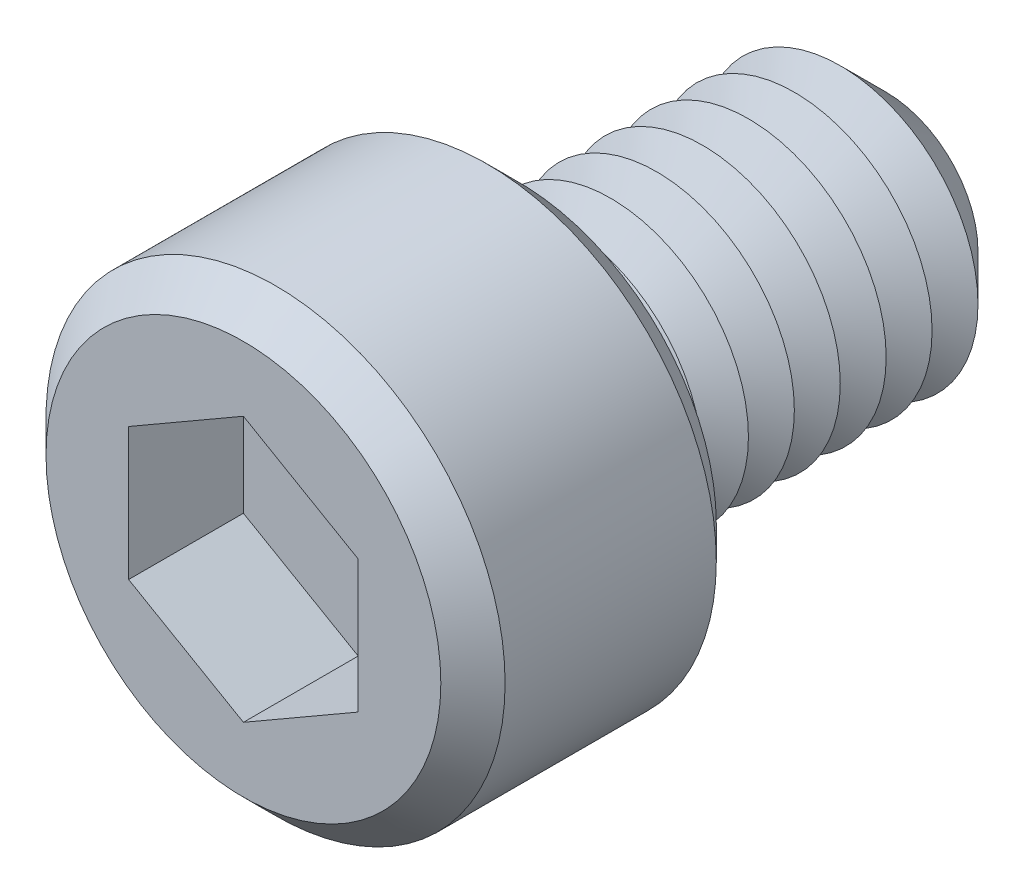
ISO-10303-21;
HEADER;
FILE_DESCRIPTION(('STEP AP214'),'2;1');
FILE_NAME('part.step','',(''),(''),'','','');
FILE_SCHEMA(('AUTOMOTIVE_DESIGN { 1 0 10303 214 1 1 1 1 }'));
ENDSEC;
DATA;
#1=APPLICATION_CONTEXT('core data for automotive mechanical design processes');
#2=APPLICATION_PROTOCOL_DEFINITION('international standard','automotive_design',2000,#1);
#3=PRODUCT_CONTEXT('',#1,'mechanical');
#4=PRODUCT('Part','Part','',(#3));
#5=PRODUCT_RELATED_PRODUCT_CATEGORY('part','',(#4));
#6=PRODUCT_DEFINITION_FORMATION('','',#4);
#7=PRODUCT_DEFINITION_CONTEXT('part definition',#1,'design');
#8=PRODUCT_DEFINITION('design','',#6,#7);
#9=PRODUCT_DEFINITION_SHAPE('','',#8);
#10=(LENGTH_UNIT() NAMED_UNIT(*) SI_UNIT(.MILLI.,.METRE.));
#11=(NAMED_UNIT(*) PLANE_ANGLE_UNIT() SI_UNIT($,.RADIAN.));
#12=(NAMED_UNIT(*) SI_UNIT($,.STERADIAN.) SOLID_ANGLE_UNIT());
#13=UNCERTAINTY_MEASURE_WITH_UNIT(LENGTH_MEASURE(1.E-05),#10,'distance_accuracy_value','');
#14=(GEOMETRIC_REPRESENTATION_CONTEXT(3) GLOBAL_UNCERTAINTY_ASSIGNED_CONTEXT((#13)) GLOBAL_UNIT_ASSIGNED_CONTEXT((#10,
#11,#12)) REPRESENTATION_CONTEXT('',''));
#15=CARTESIAN_POINT('',(0.,0.,0.));
#16=DIRECTION('',(0.,0.,1.));
#17=DIRECTION('',(1.,0.,0.));
#18=AXIS2_PLACEMENT_3D('',#15,#16,#17);
#19=CARTESIAN_POINT('',(0.,0.,6.));
#20=DIRECTION('',(0.,0.,-1.));
#21=DIRECTION('',(-1.,0.,0.));
#22=AXIS2_PLACEMENT_3D('',#19,#20,#21);
#23=CYLINDRICAL_SURFACE('',#22,5.);
#24=CARTESIAN_POINT('',(0.,0.,0.7));
#25=DIRECTION('',(0.,0.,1.));
#26=DIRECTION('',(1.,0.,0.));
#27=AXIS2_PLACEMENT_3D('',#24,#25,#26);
#28=CIRCLE('',#27,5.);
#29=CARTESIAN_POINT('',(5.,0.,0.7));
#30=VERTEX_POINT('',#29);
#31=EDGE_CURVE('E232',#30,#30,#28,.T.);
#32=ORIENTED_EDGE('',*,*,#31,.T.);
#33=EDGE_LOOP('',(#32));
#34=FACE_BOUND('',#33,.T.);
#35=CARTESIAN_POINT('',(0.,0.,5.3));
#36=DIRECTION('',(0.,0.,1.));
#37=DIRECTION('',(1.,0.,0.));
#38=AXIS2_PLACEMENT_3D('',#35,#36,#37);
#39=CIRCLE('',#38,5.);
#40=CARTESIAN_POINT('',(5.,0.,5.3));
#41=VERTEX_POINT('',#40);
#42=EDGE_CURVE('E228',#41,#41,#39,.F.);
#43=ORIENTED_EDGE('',*,*,#42,.T.);
#44=EDGE_LOOP('',(#43));
#45=FACE_BOUND('',#44,.T.);
#46=ADVANCED_FACE('F39',(#34,#45),#23,.T.);
#47=CARTESIAN_POINT('',(0.,0.,6.));
#48=DIRECTION('',(0.,0.,1.));
#49=DIRECTION('',(1.,0.,0.));
#50=AXIS2_PLACEMENT_3D('',#47,#48,#49);
#51=PLANE('',#50);
#52=CARTESIAN_POINT('',(0.,0.,6.));
#53=DIRECTION('',(0.,0.,1.));
#54=DIRECTION('',(1.,0.,0.));
#55=AXIS2_PLACEMENT_3D('',#52,#53,#54);
#56=CIRCLE('',#55,4.30000000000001);
#57=CARTESIAN_POINT('',(4.30000000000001,0.,6.));
#58=VERTEX_POINT('',#57);
#59=EDGE_CURVE('E11',#58,#58,#56,.T.);
#60=ORIENTED_EDGE('',*,*,#59,.T.);
#61=EDGE_LOOP('',(#60));
#62=FACE_BOUND('',#61,.T.);
#63=DIRECTION('',(-0.866025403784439,0.5,0.));
#64=VECTOR('',#63,1.);
#65=CARTESIAN_POINT('',(2.5,1.44337567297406,6.));
#66=LINE('',#65,#64);
#67=CARTESIAN_POINT('',(2.5,1.44337567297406,6.));
#68=VERTEX_POINT('',#67);
#69=CARTESIAN_POINT('',(0.,2.88675134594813,6.));
#70=VERTEX_POINT('',#69);
#71=EDGE_CURVE('E55',#68,#70,#66,.T.);
#72=ORIENTED_EDGE('',*,*,#71,.F.);
#73=DIRECTION('',(0.,1.,0.));
#74=VECTOR('',#73,1.);
#75=CARTESIAN_POINT('',(2.5,-1.44337567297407,6.));
#76=LINE('',#75,#74);
#77=CARTESIAN_POINT('',(2.5,-1.44337567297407,6.));
#78=VERTEX_POINT('',#77);
#79=EDGE_CURVE('E151',#78,#68,#76,.T.);
#80=ORIENTED_EDGE('',*,*,#79,.F.);
#81=DIRECTION('',(0.866025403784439,0.5,0.));
#82=VECTOR('',#81,1.);
#83=CARTESIAN_POINT('',(0.,-2.88675134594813,6.));
#84=LINE('',#83,#82);
#85=CARTESIAN_POINT('',(0.,-2.88675134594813,6.));
#86=VERTEX_POINT('',#85);
#87=EDGE_CURVE('E148',#86,#78,#84,.T.);
#88=ORIENTED_EDGE('',*,*,#87,.F.);
#89=DIRECTION('',(0.866025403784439,-0.5,0.));
#90=VECTOR('',#89,1.);
#91=CARTESIAN_POINT('',(-2.5,-1.44337567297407,6.));
#92=LINE('',#91,#90);
#93=CARTESIAN_POINT('',(-2.5,-1.44337567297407,6.));
#94=VERTEX_POINT('',#93);
#95=EDGE_CURVE('E103',#94,#86,#92,.T.);
#96=ORIENTED_EDGE('',*,*,#95,.F.);
#97=DIRECTION('',(0.,-1.,0.));
#98=VECTOR('',#97,1.);
#99=CARTESIAN_POINT('',(-2.5,1.44337567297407,6.));
#100=LINE('',#99,#98);
#101=CARTESIAN_POINT('',(-2.5,1.44337567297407,6.));
#102=VERTEX_POINT('',#101);
#103=EDGE_CURVE('E142',#102,#94,#100,.T.);
#104=ORIENTED_EDGE('',*,*,#103,.F.);
#105=DIRECTION('',(-0.866025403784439,-0.5,0.));
#106=VECTOR('',#105,1.);
#107=CARTESIAN_POINT('',(0.,2.88675134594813,6.));
#108=LINE('',#107,#106);
#109=EDGE_CURVE('E137',#70,#102,#108,.T.);
#110=ORIENTED_EDGE('',*,*,#109,.F.);
#111=EDGE_LOOP('',(#72,#80,#88,#96,#104,#110));
#112=FACE_BOUND('',#111,.T.);
#113=ADVANCED_FACE('F250',(#62,#112),#51,.T.);
#114=CARTESIAN_POINT('',(0.,0.,0.));
#115=DIRECTION('',(0.,0.,1.));
#116=DIRECTION('',(1.,0.,0.));
#117=AXIS2_PLACEMENT_3D('',#114,#115,#116);
#118=PLANE('',#117);
#119=CARTESIAN_POINT('',(0.,0.,0.));
#120=DIRECTION('',(0.,0.,1.));
#121=DIRECTION('',(1.,0.,0.));
#122=AXIS2_PLACEMENT_3D('',#119,#120,#121);
#123=CIRCLE('',#122,4.3);
#124=CARTESIAN_POINT('',(4.3,0.,0.));
#125=VERTEX_POINT('',#124);
#126=EDGE_CURVE('E48',#125,#125,#123,.F.);
#127=ORIENTED_EDGE('',*,*,#126,.T.);
#128=EDGE_LOOP('',(#127));
#129=FACE_BOUND('',#128,.T.);
#130=CARTESIAN_POINT('',(0.,0.,0.));
#131=DIRECTION('',(0.,0.,1.));
#132=DIRECTION('',(1.,0.,0.));
#133=AXIS2_PLACEMENT_3D('',#130,#131,#132);
#134=CIRCLE('',#133,3.);
#135=CARTESIAN_POINT('',(3.,0.,0.));
#136=VERTEX_POINT('',#135);
#137=EDGE_CURVE('E221',#136,#136,#134,.T.);
#138=ORIENTED_EDGE('',*,*,#137,.T.);
#139=EDGE_LOOP('',(#138));
#140=FACE_BOUND('',#139,.T.);
#141=ADVANCED_FACE('F239',(#129,#140),#118,.F.);
#142=CARTESIAN_POINT('',(0.,0.,0.));
#143=DIRECTION('',(0.,0.,1.));
#144=DIRECTION('',(1.,0.,0.));
#145=AXIS2_PLACEMENT_3D('',#142,#143,#144);
#146=CONICAL_SURFACE('',#145,3.,1.0471975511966);
#147=CARTESIAN_POINT('',(0.,0.,-0.500000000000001));
#148=DIRECTION('',(0.,0.,1.));
#149=DIRECTION('',(1.,0.,0.));
#150=AXIS2_PLACEMENT_3D('',#147,#148,#149);
#151=CIRCLE('',#150,2.13397459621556);
#152=CARTESIAN_POINT('',(2.13397459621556,0.,-0.500000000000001));
#153=VERTEX_POINT('',#152);
#154=EDGE_CURVE('E217',#153,#153,#151,.T.);
#155=ORIENTED_EDGE('',*,*,#154,.T.);
#156=EDGE_LOOP('',(#155));
#157=FACE_BOUND('',#156,.T.);
#158=ORIENTED_EDGE('',*,*,#137,.F.);
#159=EDGE_LOOP('',(#158));
#160=FACE_BOUND('',#159,.T.);
#161=ADVANCED_FACE('F356',(#157,#160),#146,.T.);
#162=CARTESIAN_POINT('',(0.,0.,-0.500000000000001));
#163=DIRECTION('',(0.,0.,-1.));
#164=DIRECTION('',(-1.,0.,0.));
#165=AXIS2_PLACEMENT_3D('',#162,#163,#164);
#166=CONICAL_SURFACE('',#165,2.13397459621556,1.0471975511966);
#167=CARTESIAN_POINT('',(0.,0.,-1.));
#168=DIRECTION('',(0.,0.,1.));
#169=DIRECTION('',(1.,0.,0.));
#170=AXIS2_PLACEMENT_3D('',#167,#168,#169);
#171=CIRCLE('',#170,3.);
#172=CARTESIAN_POINT('',(3.,0.,-1.));
#173=VERTEX_POINT('',#172);
#174=EDGE_CURVE('E213',#173,#173,#171,.T.);
#175=ORIENTED_EDGE('',*,*,#174,.T.);
#176=EDGE_LOOP('',(#175));
#177=FACE_BOUND('',#176,.T.);
#178=ORIENTED_EDGE('',*,*,#154,.F.);
#179=EDGE_LOOP('',(#178));
#180=FACE_BOUND('',#179,.T.);
#181=ADVANCED_FACE('F352',(#177,#180),#166,.T.);
#182=CARTESIAN_POINT('',(0.,0.,-1.));
#183=DIRECTION('',(0.,0.,1.));
#184=DIRECTION('',(1.,0.,0.));
#185=AXIS2_PLACEMENT_3D('',#182,#183,#184);
#186=CONICAL_SURFACE('',#185,3.,1.0471975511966);
#187=CARTESIAN_POINT('',(0.,0.,-1.5));
#188=DIRECTION('',(0.,0.,1.));
#189=DIRECTION('',(1.,0.,0.));
#190=AXIS2_PLACEMENT_3D('',#187,#188,#189);
#191=CIRCLE('',#190,2.13397459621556);
#192=CARTESIAN_POINT('',(2.13397459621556,0.,-1.5));
#193=VERTEX_POINT('',#192);
#194=EDGE_CURVE('E209',#193,#193,#191,.T.);
#195=ORIENTED_EDGE('',*,*,#194,.T.);
#196=EDGE_LOOP('',(#195));
#197=FACE_BOUND('',#196,.T.);
#198=ORIENTED_EDGE('',*,*,#174,.F.);
#199=EDGE_LOOP('',(#198));
#200=FACE_BOUND('',#199,.T.);
#201=ADVANCED_FACE('F348',(#197,#200),#186,.T.);
#202=CARTESIAN_POINT('',(0.,0.,-1.5));
#203=DIRECTION('',(0.,0.,-1.));
#204=DIRECTION('',(-1.,0.,0.));
#205=AXIS2_PLACEMENT_3D('',#202,#203,#204);
#206=CONICAL_SURFACE('',#205,2.13397459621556,1.0471975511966);
#207=CARTESIAN_POINT('',(0.,0.,-2.));
#208=DIRECTION('',(0.,0.,1.));
#209=DIRECTION('',(1.,0.,0.));
#210=AXIS2_PLACEMENT_3D('',#207,#208,#209);
#211=CIRCLE('',#210,3.);
#212=CARTESIAN_POINT('',(3.,0.,-2.));
#213=VERTEX_POINT('',#212);
#214=EDGE_CURVE('E205',#213,#213,#211,.T.);
#215=ORIENTED_EDGE('',*,*,#214,.T.);
#216=EDGE_LOOP('',(#215));
#217=FACE_BOUND('',#216,.T.);
#218=ORIENTED_EDGE('',*,*,#194,.F.);
#219=EDGE_LOOP('',(#218));
#220=FACE_BOUND('',#219,.T.);
#221=ADVANCED_FACE('F344',(#217,#220),#206,.T.);
#222=CARTESIAN_POINT('',(0.,0.,-2.));
#223=DIRECTION('',(0.,0.,1.));
#224=DIRECTION('',(1.,0.,0.));
#225=AXIS2_PLACEMENT_3D('',#222,#223,#224);
#226=CONICAL_SURFACE('',#225,3.,1.0471975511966);
#227=CARTESIAN_POINT('',(0.,0.,-2.5));
#228=DIRECTION('',(0.,0.,1.));
#229=DIRECTION('',(1.,0.,0.));
#230=AXIS2_PLACEMENT_3D('',#227,#228,#229);
#231=CIRCLE('',#230,2.13397459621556);
#232=CARTESIAN_POINT('',(2.13397459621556,0.,-2.5));
#233=VERTEX_POINT('',#232);
#234=EDGE_CURVE('E202',#233,#233,#231,.T.);
#235=ORIENTED_EDGE('',*,*,#234,.T.);
#236=EDGE_LOOP('',(#235));
#237=FACE_BOUND('',#236,.T.);
#238=ORIENTED_EDGE('',*,*,#214,.F.);
#239=EDGE_LOOP('',(#238));
#240=FACE_BOUND('',#239,.T.);
#241=ADVANCED_FACE('F340',(#237,#240),#226,.T.);
#242=CARTESIAN_POINT('',(0.,0.,-2.5));
#243=DIRECTION('',(0.,0.,-1.));
#244=DIRECTION('',(-1.,0.,0.));
#245=AXIS2_PLACEMENT_3D('',#242,#243,#244);
#246=CONICAL_SURFACE('',#245,2.13397459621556,1.0471975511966);
#247=CARTESIAN_POINT('',(0.,0.,-3.));
#248=DIRECTION('',(0.,0.,1.));
#249=DIRECTION('',(1.,0.,0.));
#250=AXIS2_PLACEMENT_3D('',#247,#248,#249);
#251=CIRCLE('',#250,3.);
#252=CARTESIAN_POINT('',(3.,0.,-3.));
#253=VERTEX_POINT('',#252);
#254=EDGE_CURVE('E198',#253,#253,#251,.T.);
#255=ORIENTED_EDGE('',*,*,#254,.T.);
#256=EDGE_LOOP('',(#255));
#257=FACE_BOUND('',#256,.T.);
#258=ORIENTED_EDGE('',*,*,#234,.F.);
#259=EDGE_LOOP('',(#258));
#260=FACE_BOUND('',#259,.T.);
#261=ADVANCED_FACE('F336',(#257,#260),#246,.T.);
#262=CARTESIAN_POINT('',(0.,0.,-3.));
#263=DIRECTION('',(0.,0.,1.));
#264=DIRECTION('',(1.,0.,0.));
#265=AXIS2_PLACEMENT_3D('',#262,#263,#264);
#266=CONICAL_SURFACE('',#265,3.,1.0471975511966);
#267=CARTESIAN_POINT('',(0.,0.,-3.5));
#268=DIRECTION('',(0.,0.,1.));
#269=DIRECTION('',(1.,0.,0.));
#270=AXIS2_PLACEMENT_3D('',#267,#268,#269);
#271=CIRCLE('',#270,2.13397459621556);
#272=CARTESIAN_POINT('',(2.13397459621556,0.,-3.5));
#273=VERTEX_POINT('',#272);
#274=EDGE_CURVE('E194',#273,#273,#271,.T.);
#275=ORIENTED_EDGE('',*,*,#274,.T.);
#276=EDGE_LOOP('',(#275));
#277=FACE_BOUND('',#276,.T.);
#278=ORIENTED_EDGE('',*,*,#254,.F.);
#279=EDGE_LOOP('',(#278));
#280=FACE_BOUND('',#279,.T.);
#281=ADVANCED_FACE('F332',(#277,#280),#266,.T.);
#282=CARTESIAN_POINT('',(0.,0.,-3.5));
#283=DIRECTION('',(0.,0.,-1.));
#284=DIRECTION('',(-1.,0.,0.));
#285=AXIS2_PLACEMENT_3D('',#282,#283,#284);
#286=CONICAL_SURFACE('',#285,2.13397459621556,1.0471975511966);
#287=CARTESIAN_POINT('',(0.,0.,-4.));
#288=DIRECTION('',(0.,0.,1.));
#289=DIRECTION('',(1.,0.,0.));
#290=AXIS2_PLACEMENT_3D('',#287,#288,#289);
#291=CIRCLE('',#290,3.);
#292=CARTESIAN_POINT('',(3.,0.,-4.));
#293=VERTEX_POINT('',#292);
#294=EDGE_CURVE('E190',#293,#293,#291,.T.);
#295=ORIENTED_EDGE('',*,*,#294,.T.);
#296=EDGE_LOOP('',(#295));
#297=FACE_BOUND('',#296,.T.);
#298=ORIENTED_EDGE('',*,*,#274,.F.);
#299=EDGE_LOOP('',(#298));
#300=FACE_BOUND('',#299,.T.);
#301=ADVANCED_FACE('F328',(#297,#300),#286,.T.);
#302=CARTESIAN_POINT('',(0.,0.,-4.));
#303=DIRECTION('',(0.,0.,1.));
#304=DIRECTION('',(1.,0.,0.));
#305=AXIS2_PLACEMENT_3D('',#302,#303,#304);
#306=CONICAL_SURFACE('',#305,3.,1.0471975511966);
#307=CARTESIAN_POINT('',(0.,0.,-4.5));
#308=DIRECTION('',(0.,0.,1.));
#309=DIRECTION('',(1.,0.,0.));
#310=AXIS2_PLACEMENT_3D('',#307,#308,#309);
#311=CIRCLE('',#310,2.13397459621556);
#312=CARTESIAN_POINT('',(2.13397459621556,0.,-4.5));
#313=VERTEX_POINT('',#312);
#314=EDGE_CURVE('E186',#313,#313,#311,.T.);
#315=ORIENTED_EDGE('',*,*,#314,.T.);
#316=EDGE_LOOP('',(#315));
#317=FACE_BOUND('',#316,.T.);
#318=ORIENTED_EDGE('',*,*,#294,.F.);
#319=EDGE_LOOP('',(#318));
#320=FACE_BOUND('',#319,.T.);
#321=ADVANCED_FACE('F324',(#317,#320),#306,.T.);
#322=CARTESIAN_POINT('',(0.,0.,-4.5));
#323=DIRECTION('',(0.,0.,-1.));
#324=DIRECTION('',(-1.,0.,0.));
#325=AXIS2_PLACEMENT_3D('',#322,#323,#324);
#326=CONICAL_SURFACE('',#325,2.13397459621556,1.0471975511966);
#327=CARTESIAN_POINT('',(0.,0.,-5.));
#328=DIRECTION('',(0.,0.,1.));
#329=DIRECTION('',(1.,0.,0.));
#330=AXIS2_PLACEMENT_3D('',#327,#328,#329);
#331=CIRCLE('',#330,3.);
#332=CARTESIAN_POINT('',(3.,0.,-5.));
#333=VERTEX_POINT('',#332);
#334=EDGE_CURVE('E182',#333,#333,#331,.T.);
#335=ORIENTED_EDGE('',*,*,#334,.T.);
#336=EDGE_LOOP('',(#335));
#337=FACE_BOUND('',#336,.T.);
#338=ORIENTED_EDGE('',*,*,#314,.F.);
#339=EDGE_LOOP('',(#338));
#340=FACE_BOUND('',#339,.T.);
#341=ADVANCED_FACE('F320',(#337,#340),#326,.T.);
#342=CARTESIAN_POINT('',(0.,0.,-5.));
#343=DIRECTION('',(0.,0.,1.));
#344=DIRECTION('',(1.,0.,0.));
#345=AXIS2_PLACEMENT_3D('',#342,#343,#344);
#346=CONICAL_SURFACE('',#345,3.,1.0471975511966);
#347=CARTESIAN_POINT('',(0.,0.,-5.5));
#348=DIRECTION('',(0.,0.,1.));
#349=DIRECTION('',(1.,0.,0.));
#350=AXIS2_PLACEMENT_3D('',#347,#348,#349);
#351=CIRCLE('',#350,2.13397459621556);
#352=CARTESIAN_POINT('',(2.13397459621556,0.,-5.5));
#353=VERTEX_POINT('',#352);
#354=EDGE_CURVE('E178',#353,#353,#351,.T.);
#355=ORIENTED_EDGE('',*,*,#354,.T.);
#356=EDGE_LOOP('',(#355));
#357=FACE_BOUND('',#356,.T.);
#358=ORIENTED_EDGE('',*,*,#334,.F.);
#359=EDGE_LOOP('',(#358));
#360=FACE_BOUND('',#359,.T.);
#361=ADVANCED_FACE('F316',(#357,#360),#346,.T.);
#362=CARTESIAN_POINT('',(0.,0.,-5.5));
#363=DIRECTION('',(0.,0.,-1.));
#364=DIRECTION('',(-1.,0.,0.));
#365=AXIS2_PLACEMENT_3D('',#362,#363,#364);
#366=CONICAL_SURFACE('',#365,2.13397459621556,1.0471975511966);
#367=CARTESIAN_POINT('',(0.,0.,-6.));
#368=DIRECTION('',(0.,0.,1.));
#369=DIRECTION('',(1.,0.,0.));
#370=AXIS2_PLACEMENT_3D('',#367,#368,#369);
#371=CIRCLE('',#370,3.);
#372=CARTESIAN_POINT('',(3.,0.,-6.));
#373=VERTEX_POINT('',#372);
#374=EDGE_CURVE('E174',#373,#373,#371,.T.);
#375=ORIENTED_EDGE('',*,*,#374,.T.);
#376=EDGE_LOOP('',(#375));
#377=FACE_BOUND('',#376,.T.);
#378=ORIENTED_EDGE('',*,*,#354,.F.);
#379=EDGE_LOOP('',(#378));
#380=FACE_BOUND('',#379,.T.);
#381=ADVANCED_FACE('F312',(#377,#380),#366,.T.);
#382=CARTESIAN_POINT('',(0.,0.,-6.));
#383=DIRECTION('',(0.,0.,1.));
#384=DIRECTION('',(1.,0.,0.));
#385=AXIS2_PLACEMENT_3D('',#382,#383,#384);
#386=CONICAL_SURFACE('',#385,3.,1.0471975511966);
#387=CARTESIAN_POINT('',(0.,0.,-6.5));
#388=DIRECTION('',(0.,0.,1.));
#389=DIRECTION('',(1.,0.,0.));
#390=AXIS2_PLACEMENT_3D('',#387,#388,#389);
#391=CIRCLE('',#390,2.13397459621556);
#392=CARTESIAN_POINT('',(2.13397459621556,0.,-6.5));
#393=VERTEX_POINT('',#392);
#394=EDGE_CURVE('E170',#393,#393,#391,.T.);
#395=ORIENTED_EDGE('',*,*,#394,.T.);
#396=EDGE_LOOP('',(#395));
#397=FACE_BOUND('',#396,.T.);
#398=ORIENTED_EDGE('',*,*,#374,.F.);
#399=EDGE_LOOP('',(#398));
#400=FACE_BOUND('',#399,.T.);
#401=ADVANCED_FACE('F308',(#397,#400),#386,.T.);
#402=CARTESIAN_POINT('',(0.,0.,-6.5));
#403=DIRECTION('',(0.,0.,-1.));
#404=DIRECTION('',(-1.,0.,0.));
#405=AXIS2_PLACEMENT_3D('',#402,#403,#404);
#406=CONICAL_SURFACE('',#405,2.13397459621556,1.0471975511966);
#407=CARTESIAN_POINT('',(0.,0.,-7.));
#408=DIRECTION('',(0.,0.,1.));
#409=DIRECTION('',(1.,0.,0.));
#410=AXIS2_PLACEMENT_3D('',#407,#408,#409);
#411=CIRCLE('',#410,3.);
#412=CARTESIAN_POINT('',(3.,0.,-7.));
#413=VERTEX_POINT('',#412);
#414=EDGE_CURVE('E157',#413,#413,#411,.T.);
#415=ORIENTED_EDGE('',*,*,#414,.T.);
#416=EDGE_LOOP('',(#415));
#417=FACE_BOUND('',#416,.T.);
#418=ORIENTED_EDGE('',*,*,#394,.F.);
#419=EDGE_LOOP('',(#418));
#420=FACE_BOUND('',#419,.T.);
#421=ADVANCED_FACE('F304',(#417,#420),#406,.T.);
#422=CARTESIAN_POINT('',(0.,0.,-8.));
#423=DIRECTION('',(0.,0.,-1.));
#424=DIRECTION('',(-1.,0.,0.));
#425=AXIS2_PLACEMENT_3D('',#422,#423,#424);
#426=PLANE('',#425);
#427=CARTESIAN_POINT('',(0.,0.,-8.));
#428=DIRECTION('',(0.,0.,-1.));
#429=DIRECTION('',(-1.,0.,0.));
#430=AXIS2_PLACEMENT_3D('',#427,#428,#429);
#431=CIRCLE('',#430,0.8);
#432=CARTESIAN_POINT('',(-0.8,0.,-8.));
#433=VERTEX_POINT('',#432);
#434=EDGE_CURVE('E138',#433,#433,#431,.F.);
#435=ORIENTED_EDGE('',*,*,#434,.T.);
#436=EDGE_LOOP('',(#435));
#437=FACE_BOUND('',#436,.T.);
#438=CARTESIAN_POINT('',(0.,0.,-8.));
#439=DIRECTION('',(0.,0.,-1.));
#440=DIRECTION('',(-1.,0.,0.));
#441=AXIS2_PLACEMENT_3D('',#438,#439,#440);
#442=CIRCLE('',#441,2.);
#443=CARTESIAN_POINT('',(-2.,0.,-8.));
#444=VERTEX_POINT('',#443);
#445=EDGE_CURVE('E224',#444,#444,#442,.T.);
#446=ORIENTED_EDGE('',*,*,#445,.T.);
#447=EDGE_LOOP('',(#446));
#448=FACE_BOUND('',#447,.T.);
#449=ADVANCED_FACE('F307',(#437,#448),#426,.T.);
#450=CARTESIAN_POINT('',(0.,0.,-8.));
#451=DIRECTION('',(0.,0.,1.));
#452=DIRECTION('',(1.,0.,0.));
#453=AXIS2_PLACEMENT_3D('',#450,#451,#452);
#454=CONICAL_SURFACE('',#453,2.,0.785398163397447);
#455=ORIENTED_EDGE('',*,*,#414,.F.);
#456=EDGE_LOOP('',(#455));
#457=FACE_BOUND('',#456,.T.);
#458=ORIENTED_EDGE('',*,*,#445,.F.);
#459=EDGE_LOOP('',(#458));
#460=FACE_BOUND('',#459,.T.);
#461=ADVANCED_FACE('F303',(#457,#460),#454,.T.);
#462=CARTESIAN_POINT('',(2.5,1.44337567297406,3.5));
#463=DIRECTION('',(0.5,0.866025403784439,0.));
#464=DIRECTION('',(-0.866025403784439,0.5,0.));
#465=AXIS2_PLACEMENT_3D('',#462,#463,#464);
#466=PLANE('',#465);
#467=ORIENTED_EDGE('',*,*,#71,.T.);
#468=DIRECTION('',(0.,0.,1.));
#469=VECTOR('',#468,1.);
#470=CARTESIAN_POINT('',(0.,2.88675134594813,3.5));
#471=LINE('',#470,#469);
#472=CARTESIAN_POINT('',(0.,2.88675134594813,3.5));
#473=VERTEX_POINT('',#472);
#474=EDGE_CURVE('E85',#473,#70,#471,.T.);
#475=ORIENTED_EDGE('',*,*,#474,.F.);
#476=DIRECTION('',(-0.866025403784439,0.5,0.));
#477=VECTOR('',#476,1.);
#478=CARTESIAN_POINT('',(2.5,1.44337567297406,3.5));
#479=LINE('',#478,#477);
#480=CARTESIAN_POINT('',(2.5,1.44337567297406,3.5));
#481=VERTEX_POINT('',#480);
#482=EDGE_CURVE('E154',#481,#473,#479,.T.);
#483=ORIENTED_EDGE('',*,*,#482,.F.);
#484=DIRECTION('',(0.,0.,1.));
#485=VECTOR('',#484,1.);
#486=CARTESIAN_POINT('',(2.5,1.44337567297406,3.5));
#487=LINE('',#486,#485);
#488=EDGE_CURVE('E63',#481,#68,#487,.T.);
#489=ORIENTED_EDGE('',*,*,#488,.T.);
#490=EDGE_LOOP('',(#467,#475,#483,#489));
#491=FACE_BOUND('',#490,.T.);
#492=ADVANCED_FACE('F293',(#491),#466,.F.);
#493=CARTESIAN_POINT('',(2.5,-1.44337567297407,3.5));
#494=DIRECTION('',(1.,0.,0.));
#495=DIRECTION('',(0.,1.,0.));
#496=AXIS2_PLACEMENT_3D('',#493,#494,#495);
#497=PLANE('',#496);
#498=ORIENTED_EDGE('',*,*,#79,.T.);
#499=ORIENTED_EDGE('',*,*,#488,.F.);
#500=DIRECTION('',(0.,1.,0.));
#501=VECTOR('',#500,1.);
#502=CARTESIAN_POINT('',(2.5,-1.44337567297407,3.5));
#503=LINE('',#502,#501);
#504=CARTESIAN_POINT('',(2.5,-1.44337567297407,3.5));
#505=VERTEX_POINT('',#504);
#506=EDGE_CURVE('E117',#505,#481,#503,.T.);
#507=ORIENTED_EDGE('',*,*,#506,.F.);
#508=DIRECTION('',(0.,0.,1.));
#509=VECTOR('',#508,1.);
#510=CARTESIAN_POINT('',(2.5,-1.44337567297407,3.5));
#511=LINE('',#510,#509);
#512=EDGE_CURVE('E108',#505,#78,#511,.T.);
#513=ORIENTED_EDGE('',*,*,#512,.T.);
#514=EDGE_LOOP('',(#498,#499,#507,#513));
#515=FACE_BOUND('',#514,.T.);
#516=ADVANCED_FACE('F290',(#515),#497,.F.);
#517=CARTESIAN_POINT('',(0.,-2.88675134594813,3.5));
#518=DIRECTION('',(0.5,-0.866025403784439,0.));
#519=DIRECTION('',(0.866025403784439,0.5,0.));
#520=AXIS2_PLACEMENT_3D('',#517,#518,#519);
#521=PLANE('',#520);
#522=ORIENTED_EDGE('',*,*,#87,.T.);
#523=ORIENTED_EDGE('',*,*,#512,.F.);
#524=DIRECTION('',(0.866025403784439,0.5,0.));
#525=VECTOR('',#524,1.);
#526=CARTESIAN_POINT('',(0.,-2.88675134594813,3.5));
#527=LINE('',#526,#525);
#528=CARTESIAN_POINT('',(0.,-2.88675134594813,3.5));
#529=VERTEX_POINT('',#528);
#530=EDGE_CURVE('E112',#529,#505,#527,.T.);
#531=ORIENTED_EDGE('',*,*,#530,.F.);
#532=DIRECTION('',(0.,0.,1.));
#533=VECTOR('',#532,1.);
#534=CARTESIAN_POINT('',(0.,-2.88675134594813,3.5));
#535=LINE('',#534,#533);
#536=EDGE_CURVE('E96',#529,#86,#535,.T.);
#537=ORIENTED_EDGE('',*,*,#536,.T.);
#538=EDGE_LOOP('',(#522,#523,#531,#537));
#539=FACE_BOUND('',#538,.T.);
#540=ADVANCED_FACE('F113',(#539),#521,.F.);
#541=CARTESIAN_POINT('',(-2.5,-1.44337567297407,3.5));
#542=DIRECTION('',(-0.5,-0.866025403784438,0.));
#543=DIRECTION('',(0.866025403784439,-0.5,0.));
#544=AXIS2_PLACEMENT_3D('',#541,#542,#543);
#545=PLANE('',#544);
#546=ORIENTED_EDGE('',*,*,#95,.T.);
#547=ORIENTED_EDGE('',*,*,#536,.F.);
#548=DIRECTION('',(0.866025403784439,-0.5,0.));
#549=VECTOR('',#548,1.);
#550=CARTESIAN_POINT('',(-2.5,-1.44337567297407,3.5));
#551=LINE('',#550,#549);
#552=CARTESIAN_POINT('',(-2.5,-1.44337567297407,3.5));
#553=VERTEX_POINT('',#552);
#554=EDGE_CURVE('E100',#553,#529,#551,.T.);
#555=ORIENTED_EDGE('',*,*,#554,.F.);
#556=DIRECTION('',(0.,0.,1.));
#557=VECTOR('',#556,1.);
#558=CARTESIAN_POINT('',(-2.5,-1.44337567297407,3.5));
#559=LINE('',#558,#557);
#560=EDGE_CURVE('E109',#553,#94,#559,.T.);
#561=ORIENTED_EDGE('',*,*,#560,.T.);
#562=EDGE_LOOP('',(#546,#547,#555,#561));
#563=FACE_BOUND('',#562,.T.);
#564=ADVANCED_FACE('F98',(#563),#545,.F.);
#565=CARTESIAN_POINT('',(-2.5,1.44337567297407,3.5));
#566=DIRECTION('',(-1.,0.,0.));
#567=DIRECTION('',(0.,-1.,0.));
#568=AXIS2_PLACEMENT_3D('',#565,#566,#567);
#569=PLANE('',#568);
#570=ORIENTED_EDGE('',*,*,#103,.T.);
#571=ORIENTED_EDGE('',*,*,#560,.F.);
#572=DIRECTION('',(0.,-1.,0.));
#573=VECTOR('',#572,1.);
#574=CARTESIAN_POINT('',(-2.5,1.44337567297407,3.5));
#575=LINE('',#574,#573);
#576=CARTESIAN_POINT('',(-2.5,1.44337567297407,3.5));
#577=VERTEX_POINT('',#576);
#578=EDGE_CURVE('E123',#577,#553,#575,.T.);
#579=ORIENTED_EDGE('',*,*,#578,.F.);
#580=DIRECTION('',(0.,0.,1.));
#581=VECTOR('',#580,1.);
#582=CARTESIAN_POINT('',(-2.5,1.44337567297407,3.5));
#583=LINE('',#582,#581);
#584=EDGE_CURVE('E162',#577,#102,#583,.T.);
#585=ORIENTED_EDGE('',*,*,#584,.T.);
#586=EDGE_LOOP('',(#570,#571,#579,#585));
#587=FACE_BOUND('',#586,.T.);
#588=ADVANCED_FACE('F287',(#587),#569,.F.);
#589=CARTESIAN_POINT('',(0.,2.88675134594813,3.5));
#590=DIRECTION('',(-0.5,0.866025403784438,0.));
#591=DIRECTION('',(-0.866025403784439,-0.5,0.));
#592=AXIS2_PLACEMENT_3D('',#589,#590,#591);
#593=PLANE('',#592);
#594=ORIENTED_EDGE('',*,*,#109,.T.);
#595=ORIENTED_EDGE('',*,*,#584,.F.);
#596=DIRECTION('',(-0.866025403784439,-0.5,0.));
#597=VECTOR('',#596,1.);
#598=CARTESIAN_POINT('',(0.,2.88675134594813,3.5));
#599=LINE('',#598,#597);
#600=EDGE_CURVE('E129',#473,#577,#599,.T.);
#601=ORIENTED_EDGE('',*,*,#600,.F.);
#602=ORIENTED_EDGE('',*,*,#474,.T.);
#603=EDGE_LOOP('',(#594,#595,#601,#602));
#604=FACE_BOUND('',#603,.T.);
#605=ADVANCED_FACE('F265',(#604),#593,.F.);
#606=CARTESIAN_POINT('',(0.,0.,3.5));
#607=DIRECTION('',(0.,0.,1.));
#608=DIRECTION('',(1.,0.,0.));
#609=AXIS2_PLACEMENT_3D('',#606,#607,#608);
#610=PLANE('',#609);
#611=CARTESIAN_POINT('',(0.,0.,3.5));
#612=DIRECTION('',(0.,0.,1.));
#613=DIRECTION('',(1.,0.,0.));
#614=AXIS2_PLACEMENT_3D('',#611,#612,#613);
#615=CIRCLE('',#614,0.8);
#616=CARTESIAN_POINT('',(0.8,0.,3.5));
#617=VERTEX_POINT('',#616);
#618=EDGE_CURVE('E274',#617,#617,#615,.T.);
#619=ORIENTED_EDGE('',*,*,#618,.F.);
#620=EDGE_LOOP('',(#619));
#621=FACE_BOUND('',#620,.T.);
#622=ORIENTED_EDGE('',*,*,#482,.T.);
#623=ORIENTED_EDGE('',*,*,#600,.T.);
#624=ORIENTED_EDGE('',*,*,#578,.T.);
#625=ORIENTED_EDGE('',*,*,#554,.T.);
#626=ORIENTED_EDGE('',*,*,#530,.T.);
#627=ORIENTED_EDGE('',*,*,#506,.T.);
#628=EDGE_LOOP('',(#622,#623,#624,#625,#626,#627));
#629=FACE_BOUND('',#628,.T.);
#630=ADVANCED_FACE('F120',(#621,#629),#610,.T.);
#631=CARTESIAN_POINT('',(0.,0.,-10.262741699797));
#632=DIRECTION('',(0.,0.,1.));
#633=DIRECTION('',(1.,0.,0.));
#634=AXIS2_PLACEMENT_3D('',#631,#632,#633);
#635=CYLINDRICAL_SURFACE('',#634,0.8);
#636=ORIENTED_EDGE('',*,*,#618,.T.);
#637=EDGE_LOOP('',(#636));
#638=FACE_BOUND('',#637,.T.);
#639=ORIENTED_EDGE('',*,*,#434,.F.);
#640=EDGE_LOOP('',(#639));
#641=FACE_BOUND('',#640,.T.);
#642=ADVANCED_FACE('F245',(#638,#641),#635,.F.);
#643=CARTESIAN_POINT('',(0.,0.,0.7));
#644=DIRECTION('',(0.,0.,1.));
#645=DIRECTION('',(1.,0.,0.));
#646=AXIS2_PLACEMENT_3D('',#643,#644,#645);
#647=CONICAL_SURFACE('',#646,5.,0.785398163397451);
#648=ORIENTED_EDGE('',*,*,#126,.F.);
#649=EDGE_LOOP('',(#648));
#650=FACE_BOUND('',#649,.T.);
#651=ORIENTED_EDGE('',*,*,#31,.F.);
#652=EDGE_LOOP('',(#651));
#653=FACE_BOUND('',#652,.T.);
#654=ADVANCED_FACE('F242',(#650,#653),#647,.T.);
#655=CARTESIAN_POINT('',(0.,0.,6.));
#656=DIRECTION('',(0.,0.,-1.));
#657=DIRECTION('',(-1.,0.,0.));
#658=AXIS2_PLACEMENT_3D('',#655,#656,#657);
#659=CONICAL_SURFACE('',#658,4.30000000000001,0.785398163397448);
#660=ORIENTED_EDGE('',*,*,#42,.F.);
#661=EDGE_LOOP('',(#660));
#662=FACE_BOUND('',#661,.T.);
#663=ORIENTED_EDGE('',*,*,#59,.F.);
#664=EDGE_LOOP('',(#663));
#665=FACE_BOUND('',#664,.T.);
#666=ADVANCED_FACE('F41',(#662,#665),#659,.T.);
#667=CLOSED_SHELL('',(#46,#113,#141,#161,#181,#201,#221,#241,#261,#281,#301,#321,#341,#361,#381,
#401,#421,#449,#461,#492,#516,#540,#564,#588,#605,#630,#642,#654,#666));
#668=MANIFOLD_SOLID_BREP('B2',#667);
#669=ADVANCED_BREP_SHAPE_REPRESENTATION('',(#18,#668),#14);
#670=SHAPE_DEFINITION_REPRESENTATION(#9,#669);
ENDSEC;
END-ISO-10303-21;
